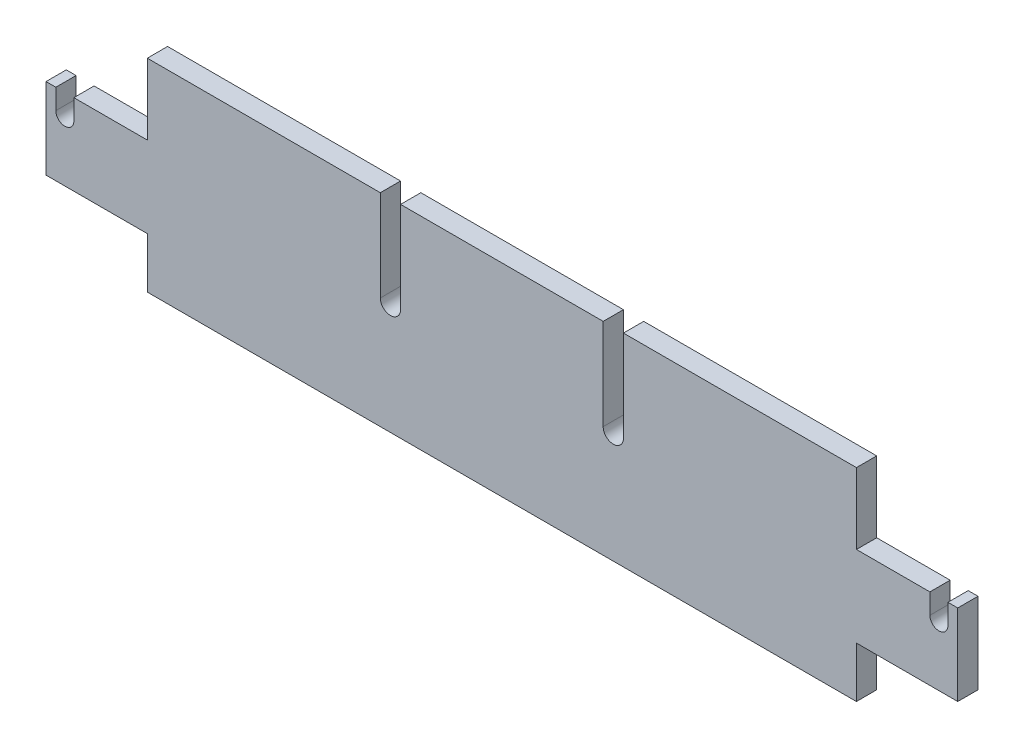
ISO-10303-21;
HEADER;
FILE_DESCRIPTION(('STEP AP214'),'2;1');
FILE_NAME('part.step','',(''),(''),'','','');
FILE_SCHEMA(('AUTOMOTIVE_DESIGN { 1 0 10303 214 1 1 1 1 }'));
ENDSEC;
DATA;
#1=APPLICATION_CONTEXT('core data for automotive mechanical design processes');
#2=APPLICATION_PROTOCOL_DEFINITION('international standard','automotive_design',2000,#1);
#3=PRODUCT_CONTEXT('',#1,'mechanical');
#4=PRODUCT('Part','Part','',(#3));
#5=PRODUCT_RELATED_PRODUCT_CATEGORY('part','',(#4));
#6=PRODUCT_DEFINITION_FORMATION('','',#4);
#7=PRODUCT_DEFINITION_CONTEXT('part definition',#1,'design');
#8=PRODUCT_DEFINITION('design','',#6,#7);
#9=PRODUCT_DEFINITION_SHAPE('','',#8);
#10=(LENGTH_UNIT() NAMED_UNIT(*) SI_UNIT(.MILLI.,.METRE.));
#11=(NAMED_UNIT(*) PLANE_ANGLE_UNIT() SI_UNIT($,.RADIAN.));
#12=(NAMED_UNIT(*) SI_UNIT($,.STERADIAN.) SOLID_ANGLE_UNIT());
#13=UNCERTAINTY_MEASURE_WITH_UNIT(LENGTH_MEASURE(1.E-05),#10,'distance_accuracy_value','');
#14=(GEOMETRIC_REPRESENTATION_CONTEXT(3) GLOBAL_UNCERTAINTY_ASSIGNED_CONTEXT((#13)) GLOBAL_UNIT_ASSIGNED_CONTEXT((#10,
#11,#12)) REPRESENTATION_CONTEXT('',''));
#15=CARTESIAN_POINT('',(0.,0.,0.));
#16=DIRECTION('',(0.,0.,1.));
#17=DIRECTION('',(1.,0.,0.));
#18=AXIS2_PLACEMENT_3D('',#15,#16,#17);
#19=CARTESIAN_POINT('',(-42.2509056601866,0.,2.));
#20=DIRECTION('',(1.,0.,0.));
#21=DIRECTION('',(0.,0.,-1.));
#22=AXIS2_PLACEMENT_3D('',#19,#20,#21);
#23=PLANE('',#22);
#24=DIRECTION('',(0.,-1.,0.));
#25=VECTOR('',#24,1.);
#26=CARTESIAN_POINT('',(-42.2509056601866,0.,0.));
#27=LINE('',#26,#25);
#28=CARTESIAN_POINT('',(-42.2509056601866,13.,0.));
#29=VERTEX_POINT('',#28);
#30=CARTESIAN_POINT('',(-42.2509056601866,11.,0.));
#31=VERTEX_POINT('',#30);
#32=EDGE_CURVE('E255',#29,#31,#27,.T.);
#33=ORIENTED_EDGE('',*,*,#32,.T.);
#34=DIRECTION('',(0.,0.,-1.));
#35=VECTOR('',#34,1.);
#36=CARTESIAN_POINT('',(-42.2509056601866,11.,2.));
#37=LINE('',#36,#35);
#38=CARTESIAN_POINT('',(-42.2509056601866,11.,2.));
#39=VERTEX_POINT('',#38);
#40=EDGE_CURVE('E11',#39,#31,#37,.T.);
#41=ORIENTED_EDGE('',*,*,#40,.F.);
#42=DIRECTION('',(0.,-1.,0.));
#43=VECTOR('',#42,1.);
#44=CARTESIAN_POINT('',(-42.2509056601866,0.,2.));
#45=LINE('',#44,#43);
#46=CARTESIAN_POINT('',(-42.2509056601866,13.,2.));
#47=VERTEX_POINT('',#46);
#48=EDGE_CURVE('E396',#47,#39,#45,.T.);
#49=ORIENTED_EDGE('',*,*,#48,.F.);
#50=DIRECTION('',(0.,0.,-1.));
#51=VECTOR('',#50,1.);
#52=CARTESIAN_POINT('',(-42.2509056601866,13.,2.));
#53=LINE('',#52,#51);
#54=EDGE_CURVE('E51',#47,#29,#53,.T.);
#55=ORIENTED_EDGE('',*,*,#54,.T.);
#56=EDGE_LOOP('',(#33,#41,#49,#55));
#57=FACE_BOUND('',#56,.T.);
#58=ADVANCED_FACE('F35',(#57),#23,.F.);
#59=CARTESIAN_POINT('',(-43.1411823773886,11.,2.));
#60=DIRECTION('',(0.,0.,-1.));
#61=DIRECTION('',(-1.,0.,0.));
#62=AXIS2_PLACEMENT_3D('',#59,#60,#61);
#63=CYLINDRICAL_SURFACE('',#62,0.890276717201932);
#64=CARTESIAN_POINT('',(-43.1411823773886,11.,0.));
#65=DIRECTION('',(0.,0.,1.));
#66=DIRECTION('',(1.,0.,0.));
#67=AXIS2_PLACEMENT_3D('',#64,#65,#66);
#68=CIRCLE('',#67,0.890276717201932);
#69=CARTESIAN_POINT('',(-44.0314590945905,11.,0.));
#70=VERTEX_POINT('',#69);
#71=EDGE_CURVE('E257',#31,#70,#68,.F.);
#72=ORIENTED_EDGE('',*,*,#71,.T.);
#73=DIRECTION('',(0.,0.,-1.));
#74=VECTOR('',#73,1.);
#75=CARTESIAN_POINT('',(-44.0314590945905,11.,2.));
#76=LINE('',#75,#74);
#77=CARTESIAN_POINT('',(-44.0314590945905,11.,2.));
#78=VERTEX_POINT('',#77);
#79=EDGE_CURVE('E43',#78,#70,#76,.T.);
#80=ORIENTED_EDGE('',*,*,#79,.F.);
#81=CARTESIAN_POINT('',(-43.1411823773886,11.,2.));
#82=DIRECTION('',(0.,0.,1.));
#83=DIRECTION('',(1.,0.,0.));
#84=AXIS2_PLACEMENT_3D('',#81,#82,#83);
#85=CIRCLE('',#84,0.890276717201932);
#86=EDGE_CURVE('E149',#39,#78,#85,.F.);
#87=ORIENTED_EDGE('',*,*,#86,.F.);
#88=ORIENTED_EDGE('',*,*,#40,.T.);
#89=EDGE_LOOP('',(#72,#80,#87,#88));
#90=FACE_BOUND('',#89,.T.);
#91=ADVANCED_FACE('F382',(#90),#63,.F.);
#92=CARTESIAN_POINT('',(-44.0314590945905,0.,2.));
#93=DIRECTION('',(1.,0.,0.));
#94=DIRECTION('',(0.,0.,-1.));
#95=AXIS2_PLACEMENT_3D('',#92,#93,#94);
#96=PLANE('',#95);
#97=DIRECTION('',(0.,-1.,0.));
#98=VECTOR('',#97,1.);
#99=CARTESIAN_POINT('',(-44.0314590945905,0.,0.));
#100=LINE('',#99,#98);
#101=CARTESIAN_POINT('',(-44.0314590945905,13.,0.));
#102=VERTEX_POINT('',#101);
#103=EDGE_CURVE('E260',#102,#70,#100,.T.);
#104=ORIENTED_EDGE('',*,*,#103,.F.);
#105=DIRECTION('',(0.,0.,-1.));
#106=VECTOR('',#105,1.);
#107=CARTESIAN_POINT('',(-44.0314590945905,13.,2.));
#108=LINE('',#107,#106);
#109=CARTESIAN_POINT('',(-44.0314590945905,13.,2.));
#110=VERTEX_POINT('',#109);
#111=EDGE_CURVE('E375',#110,#102,#108,.T.);
#112=ORIENTED_EDGE('',*,*,#111,.F.);
#113=DIRECTION('',(0.,-1.,0.));
#114=VECTOR('',#113,1.);
#115=CARTESIAN_POINT('',(-44.0314590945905,0.,2.));
#116=LINE('',#115,#114);
#117=EDGE_CURVE('E381',#110,#78,#116,.T.);
#118=ORIENTED_EDGE('',*,*,#117,.T.);
#119=ORIENTED_EDGE('',*,*,#79,.T.);
#120=EDGE_LOOP('',(#104,#112,#118,#119));
#121=FACE_BOUND('',#120,.T.);
#122=ADVANCED_FACE('F379',(#121),#96,.T.);
#123=CARTESIAN_POINT('',(0.,13.,2.));
#124=DIRECTION('',(0.,1.,0.));
#125=DIRECTION('',(0.,0.,1.));
#126=AXIS2_PLACEMENT_3D('',#123,#124,#125);
#127=PLANE('',#126);
#128=DIRECTION('',(1.,0.,0.));
#129=VECTOR('',#128,1.);
#130=CARTESIAN_POINT('',(0.,13.,0.));
#131=LINE('',#130,#129);
#132=CARTESIAN_POINT('',(-45.,13.,0.));
#133=VERTEX_POINT('',#132);
#134=EDGE_CURVE('E263',#133,#102,#131,.T.);
#135=ORIENTED_EDGE('',*,*,#134,.F.);
#136=DIRECTION('',(0.,0.,-1.));
#137=VECTOR('',#136,1.);
#138=CARTESIAN_POINT('',(-45.,13.,2.));
#139=LINE('',#138,#137);
#140=CARTESIAN_POINT('',(-45.,13.,2.));
#141=VERTEX_POINT('',#140);
#142=EDGE_CURVE('E373',#141,#133,#139,.T.);
#143=ORIENTED_EDGE('',*,*,#142,.F.);
#144=DIRECTION('',(1.,0.,0.));
#145=VECTOR('',#144,1.);
#146=CARTESIAN_POINT('',(0.,13.,2.));
#147=LINE('',#146,#145);
#148=EDGE_CURVE('E251',#141,#110,#147,.T.);
#149=ORIENTED_EDGE('',*,*,#148,.T.);
#150=ORIENTED_EDGE('',*,*,#111,.T.);
#151=EDGE_LOOP('',(#135,#143,#149,#150));
#152=FACE_BOUND('',#151,.T.);
#153=ADVANCED_FACE('F389',(#152),#127,.T.);
#154=CARTESIAN_POINT('',(-45.,0.,2.));
#155=DIRECTION('',(-1.,0.,0.));
#156=DIRECTION('',(0.,0.,1.));
#157=AXIS2_PLACEMENT_3D('',#154,#155,#156);
#158=PLANE('',#157);
#159=DIRECTION('',(0.,1.,0.));
#160=VECTOR('',#159,1.);
#161=CARTESIAN_POINT('',(-45.,0.,0.));
#162=LINE('',#161,#160);
#163=CARTESIAN_POINT('',(-45.,5.,0.));
#164=VERTEX_POINT('',#163);
#165=EDGE_CURVE('E266',#164,#133,#162,.T.);
#166=ORIENTED_EDGE('',*,*,#165,.F.);
#167=DIRECTION('',(0.,0.,-1.));
#168=VECTOR('',#167,1.);
#169=CARTESIAN_POINT('',(-45.,5.,2.));
#170=LINE('',#169,#168);
#171=CARTESIAN_POINT('',(-45.,5.,2.));
#172=VERTEX_POINT('',#171);
#173=EDGE_CURVE('E371',#172,#164,#170,.T.);
#174=ORIENTED_EDGE('',*,*,#173,.F.);
#175=DIRECTION('',(0.,1.,0.));
#176=VECTOR('',#175,1.);
#177=CARTESIAN_POINT('',(-45.,0.,2.));
#178=LINE('',#177,#176);
#179=EDGE_CURVE('E395',#172,#141,#178,.T.);
#180=ORIENTED_EDGE('',*,*,#179,.T.);
#181=ORIENTED_EDGE('',*,*,#142,.T.);
#182=EDGE_LOOP('',(#166,#174,#180,#181));
#183=FACE_BOUND('',#182,.T.);
#184=ADVANCED_FACE('F482',(#183),#158,.T.);
#185=CARTESIAN_POINT('',(0.,5.,2.));
#186=DIRECTION('',(0.,-1.,0.));
#187=DIRECTION('',(0.,0.,-1.));
#188=AXIS2_PLACEMENT_3D('',#185,#186,#187);
#189=PLANE('',#188);
#190=DIRECTION('',(-1.,0.,0.));
#191=VECTOR('',#190,1.);
#192=CARTESIAN_POINT('',(0.,5.,0.));
#193=LINE('',#192,#191);
#194=CARTESIAN_POINT('',(-35.,5.,0.));
#195=VERTEX_POINT('',#194);
#196=EDGE_CURVE('E270',#195,#164,#193,.T.);
#197=ORIENTED_EDGE('',*,*,#196,.F.);
#198=DIRECTION('',(0.,0.,-1.));
#199=VECTOR('',#198,1.);
#200=CARTESIAN_POINT('',(-35.,5.,2.));
#201=LINE('',#200,#199);
#202=CARTESIAN_POINT('',(-35.,5.,2.));
#203=VERTEX_POINT('',#202);
#204=EDGE_CURVE('E369',#203,#195,#201,.T.);
#205=ORIENTED_EDGE('',*,*,#204,.F.);
#206=DIRECTION('',(-1.,0.,0.));
#207=VECTOR('',#206,1.);
#208=CARTESIAN_POINT('',(0.,5.,2.));
#209=LINE('',#208,#207);
#210=EDGE_CURVE('E401',#203,#172,#209,.T.);
#211=ORIENTED_EDGE('',*,*,#210,.T.);
#212=ORIENTED_EDGE('',*,*,#173,.T.);
#213=EDGE_LOOP('',(#197,#205,#211,#212));
#214=FACE_BOUND('',#213,.T.);
#215=ADVANCED_FACE('F487',(#214),#189,.T.);
#216=CARTESIAN_POINT('',(-35.,0.,2.));
#217=DIRECTION('',(-1.,0.,0.));
#218=DIRECTION('',(0.,0.,1.));
#219=AXIS2_PLACEMENT_3D('',#216,#217,#218);
#220=PLANE('',#219);
#221=DIRECTION('',(0.,1.,0.));
#222=VECTOR('',#221,1.);
#223=CARTESIAN_POINT('',(-35.,0.,0.));
#224=LINE('',#223,#222);
#225=CARTESIAN_POINT('',(-35.,0.,0.));
#226=VERTEX_POINT('',#225);
#227=EDGE_CURVE('E273',#226,#195,#224,.T.);
#228=ORIENTED_EDGE('',*,*,#227,.F.);
#229=DIRECTION('',(0.,0.,-1.));
#230=VECTOR('',#229,1.);
#231=CARTESIAN_POINT('',(-35.,0.,2.));
#232=LINE('',#231,#230);
#233=CARTESIAN_POINT('',(-35.,0.,2.));
#234=VERTEX_POINT('',#233);
#235=EDGE_CURVE('E367',#234,#226,#232,.T.);
#236=ORIENTED_EDGE('',*,*,#235,.F.);
#237=DIRECTION('',(0.,1.,0.));
#238=VECTOR('',#237,1.);
#239=CARTESIAN_POINT('',(-35.,0.,2.));
#240=LINE('',#239,#238);
#241=EDGE_CURVE('E404',#234,#203,#240,.T.);
#242=ORIENTED_EDGE('',*,*,#241,.T.);
#243=ORIENTED_EDGE('',*,*,#204,.T.);
#244=EDGE_LOOP('',(#228,#236,#242,#243));
#245=FACE_BOUND('',#244,.T.);
#246=ADVANCED_FACE('F496',(#245),#220,.T.);
#247=CARTESIAN_POINT('',(0.,0.,2.));
#248=DIRECTION('',(0.,-1.,0.));
#249=DIRECTION('',(0.,0.,-1.));
#250=AXIS2_PLACEMENT_3D('',#247,#248,#249);
#251=PLANE('',#250);
#252=DIRECTION('',(-1.,0.,0.));
#253=VECTOR('',#252,1.);
#254=CARTESIAN_POINT('',(0.,0.,0.));
#255=LINE('',#254,#253);
#256=CARTESIAN_POINT('',(35.,0.,0.));
#257=VERTEX_POINT('',#256);
#258=EDGE_CURVE('E276',#257,#226,#255,.T.);
#259=ORIENTED_EDGE('',*,*,#258,.F.);
#260=DIRECTION('',(0.,0.,-1.));
#261=VECTOR('',#260,1.);
#262=CARTESIAN_POINT('',(35.,0.,2.));
#263=LINE('',#262,#261);
#264=CARTESIAN_POINT('',(35.,0.,2.));
#265=VERTEX_POINT('',#264);
#266=EDGE_CURVE('E365',#265,#257,#263,.T.);
#267=ORIENTED_EDGE('',*,*,#266,.F.);
#268=DIRECTION('',(-1.,0.,0.));
#269=VECTOR('',#268,1.);
#270=CARTESIAN_POINT('',(0.,0.,2.));
#271=LINE('',#270,#269);
#272=EDGE_CURVE('E407',#265,#234,#271,.T.);
#273=ORIENTED_EDGE('',*,*,#272,.T.);
#274=ORIENTED_EDGE('',*,*,#235,.T.);
#275=EDGE_LOOP('',(#259,#267,#273,#274));
#276=FACE_BOUND('',#275,.T.);
#277=ADVANCED_FACE('F500',(#276),#251,.T.);
#278=CARTESIAN_POINT('',(35.,0.,2.));
#279=DIRECTION('',(-1.,0.,0.));
#280=DIRECTION('',(0.,0.,1.));
#281=AXIS2_PLACEMENT_3D('',#278,#279,#280);
#282=PLANE('',#281);
#283=DIRECTION('',(0.,1.,0.));
#284=VECTOR('',#283,1.);
#285=CARTESIAN_POINT('',(35.,0.,0.));
#286=LINE('',#285,#284);
#287=CARTESIAN_POINT('',(35.,5.,0.));
#288=VERTEX_POINT('',#287);
#289=EDGE_CURVE('E279',#257,#288,#286,.T.);
#290=ORIENTED_EDGE('',*,*,#289,.T.);
#291=DIRECTION('',(0.,0.,-1.));
#292=VECTOR('',#291,1.);
#293=CARTESIAN_POINT('',(35.,5.,2.));
#294=LINE('',#293,#292);
#295=CARTESIAN_POINT('',(35.,5.,2.));
#296=VERTEX_POINT('',#295);
#297=EDGE_CURVE('E362',#296,#288,#294,.T.);
#298=ORIENTED_EDGE('',*,*,#297,.F.);
#299=DIRECTION('',(0.,1.,0.));
#300=VECTOR('',#299,1.);
#301=CARTESIAN_POINT('',(35.,0.,2.));
#302=LINE('',#301,#300);
#303=EDGE_CURVE('E410',#265,#296,#302,.T.);
#304=ORIENTED_EDGE('',*,*,#303,.F.);
#305=ORIENTED_EDGE('',*,*,#266,.T.);
#306=EDGE_LOOP('',(#290,#298,#304,#305));
#307=FACE_BOUND('',#306,.T.);
#308=ADVANCED_FACE('F504',(#307),#282,.F.);
#309=CARTESIAN_POINT('',(0.,5.,2.));
#310=DIRECTION('',(0.,1.,0.));
#311=DIRECTION('',(0.,0.,1.));
#312=AXIS2_PLACEMENT_3D('',#309,#310,#311);
#313=PLANE('',#312);
#314=DIRECTION('',(1.,0.,0.));
#315=VECTOR('',#314,1.);
#316=CARTESIAN_POINT('',(0.,5.,0.));
#317=LINE('',#316,#315);
#318=CARTESIAN_POINT('',(45.,5.,0.));
#319=VERTEX_POINT('',#318);
#320=EDGE_CURVE('E281',#288,#319,#317,.T.);
#321=ORIENTED_EDGE('',*,*,#320,.T.);
#322=DIRECTION('',(0.,0.,-1.));
#323=VECTOR('',#322,1.);
#324=CARTESIAN_POINT('',(45.,5.,2.));
#325=LINE('',#324,#323);
#326=CARTESIAN_POINT('',(45.,5.,2.));
#327=VERTEX_POINT('',#326);
#328=EDGE_CURVE('E359',#327,#319,#325,.T.);
#329=ORIENTED_EDGE('',*,*,#328,.F.);
#330=DIRECTION('',(1.,0.,0.));
#331=VECTOR('',#330,1.);
#332=CARTESIAN_POINT('',(0.,5.,2.));
#333=LINE('',#332,#331);
#334=EDGE_CURVE('E412',#296,#327,#333,.T.);
#335=ORIENTED_EDGE('',*,*,#334,.F.);
#336=ORIENTED_EDGE('',*,*,#297,.T.);
#337=EDGE_LOOP('',(#321,#329,#335,#336));
#338=FACE_BOUND('',#337,.T.);
#339=ADVANCED_FACE('F508',(#338),#313,.F.);
#340=CARTESIAN_POINT('',(45.,0.,2.));
#341=DIRECTION('',(-1.,0.,0.));
#342=DIRECTION('',(0.,0.,1.));
#343=AXIS2_PLACEMENT_3D('',#340,#341,#342);
#344=PLANE('',#343);
#345=DIRECTION('',(0.,1.,0.));
#346=VECTOR('',#345,1.);
#347=CARTESIAN_POINT('',(45.,0.,0.));
#348=LINE('',#347,#346);
#349=CARTESIAN_POINT('',(45.,13.,0.));
#350=VERTEX_POINT('',#349);
#351=EDGE_CURVE('E283',#319,#350,#348,.T.);
#352=ORIENTED_EDGE('',*,*,#351,.T.);
#353=DIRECTION('',(0.,0.,-1.));
#354=VECTOR('',#353,1.);
#355=CARTESIAN_POINT('',(45.,13.,2.));
#356=LINE('',#355,#354);
#357=CARTESIAN_POINT('',(45.,13.,2.));
#358=VERTEX_POINT('',#357);
#359=EDGE_CURVE('E356',#358,#350,#356,.T.);
#360=ORIENTED_EDGE('',*,*,#359,.F.);
#361=DIRECTION('',(0.,1.,0.));
#362=VECTOR('',#361,1.);
#363=CARTESIAN_POINT('',(45.,0.,2.));
#364=LINE('',#363,#362);
#365=EDGE_CURVE('E414',#327,#358,#364,.T.);
#366=ORIENTED_EDGE('',*,*,#365,.F.);
#367=ORIENTED_EDGE('',*,*,#328,.T.);
#368=EDGE_LOOP('',(#352,#360,#366,#367));
#369=FACE_BOUND('',#368,.T.);
#370=ADVANCED_FACE('F512',(#369),#344,.F.);
#371=CARTESIAN_POINT('',(0.,13.,2.));
#372=DIRECTION('',(0.,-1.,0.));
#373=DIRECTION('',(0.,0.,-1.));
#374=AXIS2_PLACEMENT_3D('',#371,#372,#373);
#375=PLANE('',#374);
#376=DIRECTION('',(-1.,0.,0.));
#377=VECTOR('',#376,1.);
#378=CARTESIAN_POINT('',(0.,13.,0.));
#379=LINE('',#378,#377);
#380=CARTESIAN_POINT('',(44.0314590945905,13.,0.));
#381=VERTEX_POINT('',#380);
#382=EDGE_CURVE('E285',#350,#381,#379,.T.);
#383=ORIENTED_EDGE('',*,*,#382,.T.);
#384=DIRECTION('',(0.,0.,-1.));
#385=VECTOR('',#384,1.);
#386=CARTESIAN_POINT('',(44.0314590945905,13.,2.));
#387=LINE('',#386,#385);
#388=CARTESIAN_POINT('',(44.0314590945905,13.,2.));
#389=VERTEX_POINT('',#388);
#390=EDGE_CURVE('E353',#389,#381,#387,.T.);
#391=ORIENTED_EDGE('',*,*,#390,.F.);
#392=DIRECTION('',(-1.,0.,0.));
#393=VECTOR('',#392,1.);
#394=CARTESIAN_POINT('',(0.,13.,2.));
#395=LINE('',#394,#393);
#396=EDGE_CURVE('E416',#358,#389,#395,.T.);
#397=ORIENTED_EDGE('',*,*,#396,.F.);
#398=ORIENTED_EDGE('',*,*,#359,.T.);
#399=EDGE_LOOP('',(#383,#391,#397,#398));
#400=FACE_BOUND('',#399,.T.);
#401=ADVANCED_FACE('F516',(#400),#375,.F.);
#402=CARTESIAN_POINT('',(44.0314590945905,0.,2.));
#403=DIRECTION('',(1.,0.,0.));
#404=DIRECTION('',(0.,0.,-1.));
#405=AXIS2_PLACEMENT_3D('',#402,#403,#404);
#406=PLANE('',#405);
#407=DIRECTION('',(0.,-1.,0.));
#408=VECTOR('',#407,1.);
#409=CARTESIAN_POINT('',(44.0314590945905,0.,0.));
#410=LINE('',#409,#408);
#411=CARTESIAN_POINT('',(44.0314590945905,11.,0.));
#412=VERTEX_POINT('',#411);
#413=EDGE_CURVE('E287',#381,#412,#410,.T.);
#414=ORIENTED_EDGE('',*,*,#413,.T.);
#415=DIRECTION('',(0.,0.,-1.));
#416=VECTOR('',#415,1.);
#417=CARTESIAN_POINT('',(44.0314590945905,11.,2.));
#418=LINE('',#417,#416);
#419=CARTESIAN_POINT('',(44.0314590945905,11.,2.));
#420=VERTEX_POINT('',#419);
#421=EDGE_CURVE('E351',#420,#412,#418,.T.);
#422=ORIENTED_EDGE('',*,*,#421,.F.);
#423=DIRECTION('',(0.,-1.,0.));
#424=VECTOR('',#423,1.);
#425=CARTESIAN_POINT('',(44.0314590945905,0.,2.));
#426=LINE('',#425,#424);
#427=EDGE_CURVE('E418',#389,#420,#426,.T.);
#428=ORIENTED_EDGE('',*,*,#427,.F.);
#429=ORIENTED_EDGE('',*,*,#390,.T.);
#430=EDGE_LOOP('',(#414,#422,#428,#429));
#431=FACE_BOUND('',#430,.T.);
#432=ADVANCED_FACE('F518',(#431),#406,.F.);
#433=CARTESIAN_POINT('',(43.1411823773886,11.,2.));
#434=DIRECTION('',(0.,0.,-1.));
#435=DIRECTION('',(-1.,0.,0.));
#436=AXIS2_PLACEMENT_3D('',#433,#434,#435);
#437=CYLINDRICAL_SURFACE('',#436,0.890276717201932);
#438=CARTESIAN_POINT('',(43.1411823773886,11.,0.));
#439=DIRECTION('',(0.,0.,1.));
#440=DIRECTION('',(1.,0.,0.));
#441=AXIS2_PLACEMENT_3D('',#438,#439,#440);
#442=CIRCLE('',#441,0.890276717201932);
#443=CARTESIAN_POINT('',(42.2509056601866,11.,0.));
#444=VERTEX_POINT('',#443);
#445=EDGE_CURVE('E291',#444,#412,#442,.T.);
#446=ORIENTED_EDGE('',*,*,#445,.F.);
#447=DIRECTION('',(0.,0.,-1.));
#448=VECTOR('',#447,1.);
#449=CARTESIAN_POINT('',(42.2509056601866,11.,2.));
#450=LINE('',#449,#448);
#451=CARTESIAN_POINT('',(42.2509056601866,11.,2.));
#452=VERTEX_POINT('',#451);
#453=EDGE_CURVE('E349',#452,#444,#450,.T.);
#454=ORIENTED_EDGE('',*,*,#453,.F.);
#455=CARTESIAN_POINT('',(43.1411823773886,11.,2.));
#456=DIRECTION('',(0.,0.,1.));
#457=DIRECTION('',(1.,0.,0.));
#458=AXIS2_PLACEMENT_3D('',#455,#456,#457);
#459=CIRCLE('',#458,0.890276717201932);
#460=EDGE_CURVE('E421',#452,#420,#459,.T.);
#461=ORIENTED_EDGE('',*,*,#460,.T.);
#462=ORIENTED_EDGE('',*,*,#421,.T.);
#463=EDGE_LOOP('',(#446,#454,#461,#462));
#464=FACE_BOUND('',#463,.T.);
#465=ADVANCED_FACE('F521',(#464),#437,.F.);
#466=CARTESIAN_POINT('',(42.2509056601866,0.,2.));
#467=DIRECTION('',(1.,0.,0.));
#468=DIRECTION('',(0.,0.,-1.));
#469=AXIS2_PLACEMENT_3D('',#466,#467,#468);
#470=PLANE('',#469);
#471=DIRECTION('',(0.,-1.,0.));
#472=VECTOR('',#471,1.);
#473=CARTESIAN_POINT('',(42.2509056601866,0.,0.));
#474=LINE('',#473,#472);
#475=CARTESIAN_POINT('',(42.2509056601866,13.,0.));
#476=VERTEX_POINT('',#475);
#477=EDGE_CURVE('E294',#476,#444,#474,.T.);
#478=ORIENTED_EDGE('',*,*,#477,.F.);
#479=DIRECTION('',(0.,0.,-1.));
#480=VECTOR('',#479,1.);
#481=CARTESIAN_POINT('',(42.2509056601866,13.,2.));
#482=LINE('',#481,#480);
#483=CARTESIAN_POINT('',(42.2509056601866,13.,2.));
#484=VERTEX_POINT('',#483);
#485=EDGE_CURVE('E347',#484,#476,#482,.T.);
#486=ORIENTED_EDGE('',*,*,#485,.F.);
#487=DIRECTION('',(0.,-1.,0.));
#488=VECTOR('',#487,1.);
#489=CARTESIAN_POINT('',(42.2509056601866,0.,2.));
#490=LINE('',#489,#488);
#491=EDGE_CURVE('E424',#484,#452,#490,.T.);
#492=ORIENTED_EDGE('',*,*,#491,.T.);
#493=ORIENTED_EDGE('',*,*,#453,.T.);
#494=EDGE_LOOP('',(#478,#486,#492,#493));
#495=FACE_BOUND('',#494,.T.);
#496=ADVANCED_FACE('F525',(#495),#470,.T.);
#497=CARTESIAN_POINT('',(35.,13.,0.));
#498=VERTEX_POINT('',#497);
#499=EDGE_CURVE('E288',#476,#498,#379,.T.);
#500=ORIENTED_EDGE('',*,*,#499,.T.);
#501=DIRECTION('',(0.,0.,-1.));
#502=VECTOR('',#501,1.);
#503=CARTESIAN_POINT('',(35.,13.,2.));
#504=LINE('',#503,#502);
#505=CARTESIAN_POINT('',(35.,13.,2.));
#506=VERTEX_POINT('',#505);
#507=EDGE_CURVE('E344',#506,#498,#504,.T.);
#508=ORIENTED_EDGE('',*,*,#507,.F.);
#509=EDGE_CURVE('E419',#484,#506,#395,.T.);
#510=ORIENTED_EDGE('',*,*,#509,.F.);
#511=ORIENTED_EDGE('',*,*,#485,.T.);
#512=EDGE_LOOP('',(#500,#508,#510,#511));
#513=FACE_BOUND('',#512,.T.);
#514=ADVANCED_FACE('F529',(#513),#375,.F.);
#515=CARTESIAN_POINT('',(35.,0.,2.));
#516=DIRECTION('',(-1.,0.,0.));
#517=DIRECTION('',(0.,0.,1.));
#518=AXIS2_PLACEMENT_3D('',#515,#516,#517);
#519=PLANE('',#518);
#520=DIRECTION('',(0.,1.,0.));
#521=VECTOR('',#520,1.);
#522=CARTESIAN_POINT('',(35.,0.,0.));
#523=LINE('',#522,#521);
#524=CARTESIAN_POINT('',(35.,20.,0.));
#525=VERTEX_POINT('',#524);
#526=EDGE_CURVE('E297',#498,#525,#523,.T.);
#527=ORIENTED_EDGE('',*,*,#526,.T.);
#528=DIRECTION('',(0.,0.,-1.));
#529=VECTOR('',#528,1.);
#530=CARTESIAN_POINT('',(35.,20.,2.));
#531=LINE('',#530,#529);
#532=CARTESIAN_POINT('',(35.,20.,2.));
#533=VERTEX_POINT('',#532);
#534=EDGE_CURVE('E341',#533,#525,#531,.T.);
#535=ORIENTED_EDGE('',*,*,#534,.F.);
#536=DIRECTION('',(0.,1.,0.));
#537=VECTOR('',#536,1.);
#538=CARTESIAN_POINT('',(35.,0.,2.));
#539=LINE('',#538,#537);
#540=EDGE_CURVE('E427',#506,#533,#539,.T.);
#541=ORIENTED_EDGE('',*,*,#540,.F.);
#542=ORIENTED_EDGE('',*,*,#507,.T.);
#543=EDGE_LOOP('',(#527,#535,#541,#542));
#544=FACE_BOUND('',#543,.T.);
#545=ADVANCED_FACE('F533',(#544),#519,.F.);
#546=CARTESIAN_POINT('',(0.,20.,2.));
#547=DIRECTION('',(0.,-1.,0.));
#548=DIRECTION('',(0.,0.,-1.));
#549=AXIS2_PLACEMENT_3D('',#546,#547,#548);
#550=PLANE('',#549);
#551=DIRECTION('',(-1.,0.,0.));
#552=VECTOR('',#551,1.);
#553=CARTESIAN_POINT('',(0.,20.,0.));
#554=LINE('',#553,#552);
#555=CARTESIAN_POINT('',(12.,20.,0.));
#556=VERTEX_POINT('',#555);
#557=EDGE_CURVE('E299',#525,#556,#554,.T.);
#558=ORIENTED_EDGE('',*,*,#557,.T.);
#559=DIRECTION('',(0.,0.,-1.));
#560=VECTOR('',#559,1.);
#561=CARTESIAN_POINT('',(12.,20.,2.));
#562=LINE('',#561,#560);
#563=CARTESIAN_POINT('',(12.,20.,2.));
#564=VERTEX_POINT('',#563);
#565=EDGE_CURVE('E338',#564,#556,#562,.T.);
#566=ORIENTED_EDGE('',*,*,#565,.F.);
#567=DIRECTION('',(-1.,0.,0.));
#568=VECTOR('',#567,1.);
#569=CARTESIAN_POINT('',(0.,20.,2.));
#570=LINE('',#569,#568);
#571=EDGE_CURVE('E237',#533,#564,#570,.T.);
#572=ORIENTED_EDGE('',*,*,#571,.F.);
#573=ORIENTED_EDGE('',*,*,#534,.T.);
#574=EDGE_LOOP('',(#558,#566,#572,#573));
#575=FACE_BOUND('',#574,.T.);
#576=ADVANCED_FACE('F537',(#575),#550,.F.);
#577=CARTESIAN_POINT('',(12.,0.,2.));
#578=DIRECTION('',(1.,0.,0.));
#579=DIRECTION('',(0.,1.,0.));
#580=AXIS2_PLACEMENT_3D('',#577,#578,#579);
#581=PLANE('',#580);
#582=DIRECTION('',(0.,-1.,0.));
#583=VECTOR('',#582,1.);
#584=CARTESIAN_POINT('',(12.,0.,0.));
#585=LINE('',#584,#583);
#586=CARTESIAN_POINT('',(12.,11.,0.));
#587=VERTEX_POINT('',#586);
#588=EDGE_CURVE('E301',#556,#587,#585,.T.);
#589=ORIENTED_EDGE('',*,*,#588,.T.);
#590=DIRECTION('',(0.,0.,-1.));
#591=VECTOR('',#590,1.);
#592=CARTESIAN_POINT('',(12.,11.,2.));
#593=LINE('',#592,#591);
#594=CARTESIAN_POINT('',(12.,11.,2.));
#595=VERTEX_POINT('',#594);
#596=EDGE_CURVE('E336',#595,#587,#593,.T.);
#597=ORIENTED_EDGE('',*,*,#596,.F.);
#598=DIRECTION('',(0.,-1.,0.));
#599=VECTOR('',#598,1.);
#600=CARTESIAN_POINT('',(12.,0.,2.));
#601=LINE('',#600,#599);
#602=EDGE_CURVE('E429',#564,#595,#601,.T.);
#603=ORIENTED_EDGE('',*,*,#602,.F.);
#604=ORIENTED_EDGE('',*,*,#565,.T.);
#605=EDGE_LOOP('',(#589,#597,#603,#604));
#606=FACE_BOUND('',#605,.T.);
#607=ADVANCED_FACE('F539',(#606),#581,.F.);
#608=CARTESIAN_POINT('',(11.,11.,2.));
#609=DIRECTION('',(0.,0.,-1.));
#610=DIRECTION('',(-1.,0.,0.));
#611=AXIS2_PLACEMENT_3D('',#608,#609,#610);
#612=CYLINDRICAL_SURFACE('',#611,0.999999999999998);
#613=CARTESIAN_POINT('',(11.,11.,0.));
#614=DIRECTION('',(0.,0.,1.));
#615=DIRECTION('',(1.,0.,0.));
#616=AXIS2_PLACEMENT_3D('',#613,#614,#615);
#617=CIRCLE('',#616,0.999999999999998);
#618=CARTESIAN_POINT('',(10.,11.,0.));
#619=VERTEX_POINT('',#618);
#620=EDGE_CURVE('E305',#619,#587,#617,.T.);
#621=ORIENTED_EDGE('',*,*,#620,.F.);
#622=DIRECTION('',(0.,0.,-1.));
#623=VECTOR('',#622,1.);
#624=CARTESIAN_POINT('',(10.,11.,2.));
#625=LINE('',#624,#623);
#626=CARTESIAN_POINT('',(10.,11.,2.));
#627=VERTEX_POINT('',#626);
#628=EDGE_CURVE('E334',#627,#619,#625,.T.);
#629=ORIENTED_EDGE('',*,*,#628,.F.);
#630=CARTESIAN_POINT('',(11.,11.,2.));
#631=DIRECTION('',(0.,0.,1.));
#632=DIRECTION('',(1.,0.,0.));
#633=AXIS2_PLACEMENT_3D('',#630,#631,#632);
#634=CIRCLE('',#633,0.999999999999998);
#635=EDGE_CURVE('E431',#627,#595,#634,.T.);
#636=ORIENTED_EDGE('',*,*,#635,.T.);
#637=ORIENTED_EDGE('',*,*,#596,.T.);
#638=EDGE_LOOP('',(#621,#629,#636,#637));
#639=FACE_BOUND('',#638,.T.);
#640=ADVANCED_FACE('F542',(#639),#612,.F.);
#641=CARTESIAN_POINT('',(10.,0.,2.));
#642=DIRECTION('',(1.,0.,0.));
#643=DIRECTION('',(0.,1.,0.));
#644=AXIS2_PLACEMENT_3D('',#641,#642,#643);
#645=PLANE('',#644);
#646=DIRECTION('',(0.,-1.,0.));
#647=VECTOR('',#646,1.);
#648=CARTESIAN_POINT('',(10.,0.,0.));
#649=LINE('',#648,#647);
#650=CARTESIAN_POINT('',(10.,20.,0.));
#651=VERTEX_POINT('',#650);
#652=EDGE_CURVE('E308',#651,#619,#649,.T.);
#653=ORIENTED_EDGE('',*,*,#652,.F.);
#654=DIRECTION('',(0.,0.,-1.));
#655=VECTOR('',#654,1.);
#656=CARTESIAN_POINT('',(10.,20.,2.));
#657=LINE('',#656,#655);
#658=CARTESIAN_POINT('',(10.,20.,2.));
#659=VERTEX_POINT('',#658);
#660=EDGE_CURVE('E332',#659,#651,#657,.T.);
#661=ORIENTED_EDGE('',*,*,#660,.F.);
#662=DIRECTION('',(0.,-1.,0.));
#663=VECTOR('',#662,1.);
#664=CARTESIAN_POINT('',(10.,0.,2.));
#665=LINE('',#664,#663);
#666=EDGE_CURVE('E434',#659,#627,#665,.T.);
#667=ORIENTED_EDGE('',*,*,#666,.T.);
#668=ORIENTED_EDGE('',*,*,#628,.T.);
#669=EDGE_LOOP('',(#653,#661,#667,#668));
#670=FACE_BOUND('',#669,.T.);
#671=ADVANCED_FACE('F546',(#670),#645,.T.);
#672=CARTESIAN_POINT('',(-10.,20.,0.));
#673=VERTEX_POINT('',#672);
#674=EDGE_CURVE('E302',#651,#673,#554,.T.);
#675=ORIENTED_EDGE('',*,*,#674,.T.);
#676=DIRECTION('',(0.,0.,-1.));
#677=VECTOR('',#676,1.);
#678=CARTESIAN_POINT('',(-10.,20.,2.));
#679=LINE('',#678,#677);
#680=CARTESIAN_POINT('',(-10.,20.,2.));
#681=VERTEX_POINT('',#680);
#682=EDGE_CURVE('E329',#681,#673,#679,.T.);
#683=ORIENTED_EDGE('',*,*,#682,.F.);
#684=EDGE_CURVE('E236',#659,#681,#570,.T.);
#685=ORIENTED_EDGE('',*,*,#684,.F.);
#686=ORIENTED_EDGE('',*,*,#660,.T.);
#687=EDGE_LOOP('',(#675,#683,#685,#686));
#688=FACE_BOUND('',#687,.T.);
#689=ADVANCED_FACE('F449',(#688),#550,.F.);
#690=CARTESIAN_POINT('',(-10.,0.,2.));
#691=DIRECTION('',(1.,0.,0.));
#692=DIRECTION('',(0.,1.,0.));
#693=AXIS2_PLACEMENT_3D('',#690,#691,#692);
#694=PLANE('',#693);
#695=DIRECTION('',(0.,-1.,0.));
#696=VECTOR('',#695,1.);
#697=CARTESIAN_POINT('',(-10.,0.,0.));
#698=LINE('',#697,#696);
#699=CARTESIAN_POINT('',(-10.,11.,0.));
#700=VERTEX_POINT('',#699);
#701=EDGE_CURVE('E311',#673,#700,#698,.T.);
#702=ORIENTED_EDGE('',*,*,#701,.T.);
#703=DIRECTION('',(0.,0.,-1.));
#704=VECTOR('',#703,1.);
#705=CARTESIAN_POINT('',(-10.,11.,2.));
#706=LINE('',#705,#704);
#707=CARTESIAN_POINT('',(-10.,11.,2.));
#708=VERTEX_POINT('',#707);
#709=EDGE_CURVE('E326',#708,#700,#706,.T.);
#710=ORIENTED_EDGE('',*,*,#709,.F.);
#711=DIRECTION('',(0.,-1.,0.));
#712=VECTOR('',#711,1.);
#713=CARTESIAN_POINT('',(-10.,0.,2.));
#714=LINE('',#713,#712);
#715=EDGE_CURVE('E437',#681,#708,#714,.T.);
#716=ORIENTED_EDGE('',*,*,#715,.F.);
#717=ORIENTED_EDGE('',*,*,#682,.T.);
#718=EDGE_LOOP('',(#702,#710,#716,#717));
#719=FACE_BOUND('',#718,.T.);
#720=ADVANCED_FACE('F455',(#719),#694,.F.);
#721=CARTESIAN_POINT('',(-11.,11.,2.));
#722=DIRECTION('',(0.,0.,-1.));
#723=DIRECTION('',(-1.,0.,0.));
#724=AXIS2_PLACEMENT_3D('',#721,#722,#723);
#725=CYLINDRICAL_SURFACE('',#724,0.999999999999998);
#726=CARTESIAN_POINT('',(-11.,11.,0.));
#727=DIRECTION('',(0.,0.,1.));
#728=DIRECTION('',(1.,0.,0.));
#729=AXIS2_PLACEMENT_3D('',#726,#727,#728);
#730=CIRCLE('',#729,0.999999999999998);
#731=CARTESIAN_POINT('',(-12.,11.,0.));
#732=VERTEX_POINT('',#731);
#733=EDGE_CURVE('E313',#700,#732,#730,.F.);
#734=ORIENTED_EDGE('',*,*,#733,.T.);
#735=DIRECTION('',(0.,0.,-1.));
#736=VECTOR('',#735,1.);
#737=CARTESIAN_POINT('',(-12.,11.,2.));
#738=LINE('',#737,#736);
#739=CARTESIAN_POINT('',(-12.,11.,2.));
#740=VERTEX_POINT('',#739);
#741=EDGE_CURVE('E324',#740,#732,#738,.T.);
#742=ORIENTED_EDGE('',*,*,#741,.F.);
#743=CARTESIAN_POINT('',(-11.,11.,2.));
#744=DIRECTION('',(0.,0.,1.));
#745=DIRECTION('',(1.,0.,0.));
#746=AXIS2_PLACEMENT_3D('',#743,#744,#745);
#747=CIRCLE('',#746,0.999999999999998);
#748=EDGE_CURVE('E438',#708,#740,#747,.F.);
#749=ORIENTED_EDGE('',*,*,#748,.F.);
#750=ORIENTED_EDGE('',*,*,#709,.T.);
#751=EDGE_LOOP('',(#734,#742,#749,#750));
#752=FACE_BOUND('',#751,.T.);
#753=ADVANCED_FACE('F458',(#752),#725,.F.);
#754=CARTESIAN_POINT('',(-12.,0.,2.));
#755=DIRECTION('',(1.,0.,0.));
#756=DIRECTION('',(0.,1.,0.));
#757=AXIS2_PLACEMENT_3D('',#754,#755,#756);
#758=PLANE('',#757);
#759=DIRECTION('',(0.,-1.,0.));
#760=VECTOR('',#759,1.);
#761=CARTESIAN_POINT('',(-12.,0.,0.));
#762=LINE('',#761,#760);
#763=CARTESIAN_POINT('',(-12.,20.,0.));
#764=VERTEX_POINT('',#763);
#765=EDGE_CURVE('E316',#764,#732,#762,.T.);
#766=ORIENTED_EDGE('',*,*,#765,.F.);
#767=DIRECTION('',(0.,0.,-1.));
#768=VECTOR('',#767,1.);
#769=CARTESIAN_POINT('',(-12.,20.,2.));
#770=LINE('',#769,#768);
#771=CARTESIAN_POINT('',(-12.,20.,2.));
#772=VERTEX_POINT('',#771);
#773=EDGE_CURVE('E245',#772,#764,#770,.T.);
#774=ORIENTED_EDGE('',*,*,#773,.F.);
#775=DIRECTION('',(0.,-1.,0.));
#776=VECTOR('',#775,1.);
#777=CARTESIAN_POINT('',(-12.,0.,2.));
#778=LINE('',#777,#776);
#779=EDGE_CURVE('E233',#772,#740,#778,.T.);
#780=ORIENTED_EDGE('',*,*,#779,.T.);
#781=ORIENTED_EDGE('',*,*,#741,.T.);
#782=EDGE_LOOP('',(#766,#774,#780,#781));
#783=FACE_BOUND('',#782,.T.);
#784=ADVANCED_FACE('F443',(#783),#758,.T.);
#785=CARTESIAN_POINT('',(-35.,20.,0.));
#786=VERTEX_POINT('',#785);
#787=EDGE_CURVE('E242',#764,#786,#554,.T.);
#788=ORIENTED_EDGE('',*,*,#787,.T.);
#789=DIRECTION('',(0.,0.,-1.));
#790=VECTOR('',#789,1.);
#791=CARTESIAN_POINT('',(-35.,20.,2.));
#792=LINE('',#791,#790);
#793=CARTESIAN_POINT('',(-35.,20.,2.));
#794=VERTEX_POINT('',#793);
#795=EDGE_CURVE('E239',#794,#786,#792,.T.);
#796=ORIENTED_EDGE('',*,*,#795,.F.);
#797=EDGE_CURVE('E226',#772,#794,#570,.T.);
#798=ORIENTED_EDGE('',*,*,#797,.F.);
#799=ORIENTED_EDGE('',*,*,#773,.T.);
#800=EDGE_LOOP('',(#788,#796,#798,#799));
#801=FACE_BOUND('',#800,.T.);
#802=ADVANCED_FACE('F240',(#801),#550,.F.);
#803=CARTESIAN_POINT('',(-35.,0.,2.));
#804=DIRECTION('',(-1.,0.,0.));
#805=DIRECTION('',(0.,0.,1.));
#806=AXIS2_PLACEMENT_3D('',#803,#804,#805);
#807=PLANE('',#806);
#808=DIRECTION('',(0.,1.,0.));
#809=VECTOR('',#808,1.);
#810=CARTESIAN_POINT('',(-35.,0.,0.));
#811=LINE('',#810,#809);
#812=CARTESIAN_POINT('',(-35.,13.,0.));
#813=VERTEX_POINT('',#812);
#814=EDGE_CURVE('E319',#813,#786,#811,.T.);
#815=ORIENTED_EDGE('',*,*,#814,.F.);
#816=DIRECTION('',(0.,0.,-1.));
#817=VECTOR('',#816,1.);
#818=CARTESIAN_POINT('',(-35.,13.,2.));
#819=LINE('',#818,#817);
#820=CARTESIAN_POINT('',(-35.,13.,2.));
#821=VERTEX_POINT('',#820);
#822=EDGE_CURVE('E137',#821,#813,#819,.T.);
#823=ORIENTED_EDGE('',*,*,#822,.F.);
#824=DIRECTION('',(0.,1.,0.));
#825=VECTOR('',#824,1.);
#826=CARTESIAN_POINT('',(-35.,0.,2.));
#827=LINE('',#826,#825);
#828=EDGE_CURVE('E231',#821,#794,#827,.T.);
#829=ORIENTED_EDGE('',*,*,#828,.T.);
#830=ORIENTED_EDGE('',*,*,#795,.T.);
#831=EDGE_LOOP('',(#815,#823,#829,#830));
#832=FACE_BOUND('',#831,.T.);
#833=ADVANCED_FACE('F247',(#832),#807,.T.);
#834=EDGE_CURVE('E267',#29,#813,#131,.T.);
#835=ORIENTED_EDGE('',*,*,#834,.F.);
#836=ORIENTED_EDGE('',*,*,#54,.F.);
#837=EDGE_CURVE('E248',#47,#821,#147,.T.);
#838=ORIENTED_EDGE('',*,*,#837,.T.);
#839=ORIENTED_EDGE('',*,*,#822,.T.);
#840=EDGE_LOOP('',(#835,#836,#838,#839));
#841=FACE_BOUND('',#840,.T.);
#842=ADVANCED_FACE('F471',(#841),#127,.T.);
#843=CARTESIAN_POINT('',(0.,0.,2.));
#844=DIRECTION('',(0.,0.,1.));
#845=DIRECTION('',(1.,0.,0.));
#846=AXIS2_PLACEMENT_3D('',#843,#844,#845);
#847=PLANE('',#846);
#848=ORIENTED_EDGE('',*,*,#48,.T.);
#849=ORIENTED_EDGE('',*,*,#86,.T.);
#850=ORIENTED_EDGE('',*,*,#117,.F.);
#851=ORIENTED_EDGE('',*,*,#148,.F.);
#852=ORIENTED_EDGE('',*,*,#179,.F.);
#853=ORIENTED_EDGE('',*,*,#210,.F.);
#854=ORIENTED_EDGE('',*,*,#241,.F.);
#855=ORIENTED_EDGE('',*,*,#272,.F.);
#856=ORIENTED_EDGE('',*,*,#303,.T.);
#857=ORIENTED_EDGE('',*,*,#334,.T.);
#858=ORIENTED_EDGE('',*,*,#365,.T.);
#859=ORIENTED_EDGE('',*,*,#396,.T.);
#860=ORIENTED_EDGE('',*,*,#427,.T.);
#861=ORIENTED_EDGE('',*,*,#460,.F.);
#862=ORIENTED_EDGE('',*,*,#491,.F.);
#863=ORIENTED_EDGE('',*,*,#509,.T.);
#864=ORIENTED_EDGE('',*,*,#540,.T.);
#865=ORIENTED_EDGE('',*,*,#571,.T.);
#866=ORIENTED_EDGE('',*,*,#602,.T.);
#867=ORIENTED_EDGE('',*,*,#635,.F.);
#868=ORIENTED_EDGE('',*,*,#666,.F.);
#869=ORIENTED_EDGE('',*,*,#684,.T.);
#870=ORIENTED_EDGE('',*,*,#715,.T.);
#871=ORIENTED_EDGE('',*,*,#748,.T.);
#872=ORIENTED_EDGE('',*,*,#779,.F.);
#873=ORIENTED_EDGE('',*,*,#797,.T.);
#874=ORIENTED_EDGE('',*,*,#828,.F.);
#875=ORIENTED_EDGE('',*,*,#837,.F.);
#876=EDGE_LOOP('',(#848,#849,#850,#851,#852,#853,#854,#855,#856,#857,#858,#859,#860,#861,#862,
#863,#864,#865,#866,#867,#868,#869,#870,#871,#872,#873,#874,#875));
#877=FACE_BOUND('',#876,.T.);
#878=ADVANCED_FACE('F228',(#877),#847,.T.);
#879=CARTESIAN_POINT('',(0.,0.,0.));
#880=DIRECTION('',(0.,0.,1.));
#881=DIRECTION('',(1.,0.,0.));
#882=AXIS2_PLACEMENT_3D('',#879,#880,#881);
#883=PLANE('',#882);
#884=ORIENTED_EDGE('',*,*,#32,.F.);
#885=ORIENTED_EDGE('',*,*,#834,.T.);
#886=ORIENTED_EDGE('',*,*,#814,.T.);
#887=ORIENTED_EDGE('',*,*,#787,.F.);
#888=ORIENTED_EDGE('',*,*,#765,.T.);
#889=ORIENTED_EDGE('',*,*,#733,.F.);
#890=ORIENTED_EDGE('',*,*,#701,.F.);
#891=ORIENTED_EDGE('',*,*,#674,.F.);
#892=ORIENTED_EDGE('',*,*,#652,.T.);
#893=ORIENTED_EDGE('',*,*,#620,.T.);
#894=ORIENTED_EDGE('',*,*,#588,.F.);
#895=ORIENTED_EDGE('',*,*,#557,.F.);
#896=ORIENTED_EDGE('',*,*,#526,.F.);
#897=ORIENTED_EDGE('',*,*,#499,.F.);
#898=ORIENTED_EDGE('',*,*,#477,.T.);
#899=ORIENTED_EDGE('',*,*,#445,.T.);
#900=ORIENTED_EDGE('',*,*,#413,.F.);
#901=ORIENTED_EDGE('',*,*,#382,.F.);
#902=ORIENTED_EDGE('',*,*,#351,.F.);
#903=ORIENTED_EDGE('',*,*,#320,.F.);
#904=ORIENTED_EDGE('',*,*,#289,.F.);
#905=ORIENTED_EDGE('',*,*,#258,.T.);
#906=ORIENTED_EDGE('',*,*,#227,.T.);
#907=ORIENTED_EDGE('',*,*,#196,.T.);
#908=ORIENTED_EDGE('',*,*,#165,.T.);
#909=ORIENTED_EDGE('',*,*,#134,.T.);
#910=ORIENTED_EDGE('',*,*,#103,.T.);
#911=ORIENTED_EDGE('',*,*,#71,.F.);
#912=EDGE_LOOP('',(#884,#885,#886,#887,#888,#889,#890,#891,#892,#893,#894,#895,#896,#897,#898,
#899,#900,#901,#902,#903,#904,#905,#906,#907,#908,#909,#910,#911));
#913=FACE_BOUND('',#912,.T.);
#914=ADVANCED_FACE('F385',(#913),#883,.F.);
#915=CLOSED_SHELL('',(#58,#91,#122,#153,#184,#215,#246,#277,#308,#339,#370,#401,#432,#465,#496,
#514,#545,#576,#607,#640,#671,#689,#720,#753,#784,#802,#833,#842,#878,#914));
#916=MANIFOLD_SOLID_BREP('B2',#915);
#917=ADVANCED_BREP_SHAPE_REPRESENTATION('',(#18,#916),#14);
#918=SHAPE_DEFINITION_REPRESENTATION(#9,#917);
ENDSEC;
END-ISO-10303-21;
